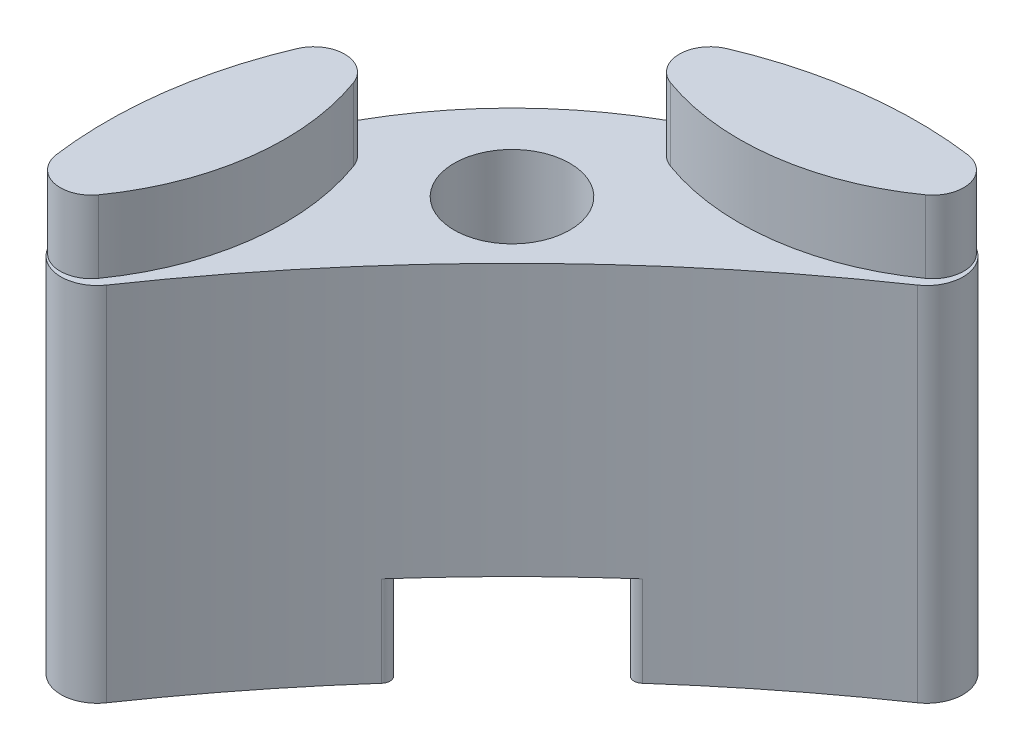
ISO-10303-21;
HEADER;
FILE_DESCRIPTION(('STEP AP214'),'2;1');
FILE_NAME('part.step','',(''),(''),'','','');
FILE_SCHEMA(('AUTOMOTIVE_DESIGN { 1 0 10303 214 1 1 1 1 }'));
ENDSEC;
DATA;
#1=APPLICATION_CONTEXT('core data for automotive mechanical design processes');
#2=APPLICATION_PROTOCOL_DEFINITION('international standard','automotive_design',2000,#1);
#3=PRODUCT_CONTEXT('',#1,'mechanical');
#4=PRODUCT('Part','Part','',(#3));
#5=PRODUCT_RELATED_PRODUCT_CATEGORY('part','',(#4));
#6=PRODUCT_DEFINITION_FORMATION('','',#4);
#7=PRODUCT_DEFINITION_CONTEXT('part definition',#1,'design');
#8=PRODUCT_DEFINITION('design','',#6,#7);
#9=PRODUCT_DEFINITION_SHAPE('','',#8);
#10=(LENGTH_UNIT() NAMED_UNIT(*) SI_UNIT(.MILLI.,.METRE.));
#11=(NAMED_UNIT(*) PLANE_ANGLE_UNIT() SI_UNIT($,.RADIAN.));
#12=(NAMED_UNIT(*) SI_UNIT($,.STERADIAN.) SOLID_ANGLE_UNIT());
#13=UNCERTAINTY_MEASURE_WITH_UNIT(LENGTH_MEASURE(1.E-05),#10,'distance_accuracy_value','');
#14=(GEOMETRIC_REPRESENTATION_CONTEXT(3) GLOBAL_UNCERTAINTY_ASSIGNED_CONTEXT((#13)) GLOBAL_UNIT_ASSIGNED_CONTEXT((#10,
#11,#12)) REPRESENTATION_CONTEXT('',''));
#15=CARTESIAN_POINT('',(0.,0.,0.));
#16=DIRECTION('',(0.,0.,1.));
#17=DIRECTION('',(1.,0.,0.));
#18=AXIS2_PLACEMENT_3D('',#15,#16,#17);
#19=CARTESIAN_POINT('',(-18.156339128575,-20.,-12.423660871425));
#20=DIRECTION('',(0.,1.,0.));
#21=DIRECTION('',(0.,0.,1.));
#22=AXIS2_PLACEMENT_3D('',#19,#20,#21);
#23=PLANE('',#22);
#24=CARTESIAN_POINT('',(0.,-20.,0.));
#25=DIRECTION('',(0.,1.,0.));
#26=DIRECTION('',(0.,0.,-1.));
#27=AXIS2_PLACEMENT_3D('',#24,#25,#26);
#28=CIRCLE('',#27,43.);
#29=CARTESIAN_POINT('',(-24.282609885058,-20.,-35.487390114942));
#30=VERTEX_POINT('',#29);
#31=CARTESIAN_POINT('',(-28.5515477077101,-20.,-32.1529022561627));
#32=VERTEX_POINT('',#31);
#33=EDGE_CURVE('E263',#30,#32,#28,.T.);
#34=ORIENTED_EDGE('',*,*,#33,.T.);
#35=CARTESIAN_POINT('',(-28.7175450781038,-20.,-32.3398377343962));
#36=DIRECTION('',(0.,1.,0.));
#37=DIRECTION('',(0.,0.,1.));
#38=AXIS2_PLACEMENT_3D('',#35,#36,#37);
#39=CIRCLE('',#38,0.25);
#40=CARTESIAN_POINT('',(-28.9662159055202,-20.,-32.3140924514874));
#41=VERTEX_POINT('',#40);
#42=EDGE_CURVE('E292',#32,#41,#39,.F.);
#43=ORIENTED_EDGE('',*,*,#42,.T.);
#44=CARTESIAN_POINT('',(-32.,-20.,-32.));
#45=DIRECTION('',(0.,-1.,0.));
#46=DIRECTION('',(0.,0.,-1.));
#47=AXIS2_PLACEMENT_3D('',#44,#45,#46);
#48=CIRCLE('',#47,3.05);
#49=CARTESIAN_POINT('',(-32.2935188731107,-20.,-35.0358436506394));
#50=VERTEX_POINT('',#49);
#51=EDGE_CURVE('E235',#50,#41,#48,.T.);
#52=ORIENTED_EDGE('',*,*,#51,.F.);
#53=CARTESIAN_POINT('',(-32.3175777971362,-20.,-35.2846832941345));
#54=DIRECTION('',(0.,1.,0.));
#55=DIRECTION('',(0.,0.,1.));
#56=AXIS2_PLACEMENT_3D('',#53,#54,#55);
#57=CIRCLE('',#56,0.25);
#58=CARTESIAN_POINT('',(-32.457220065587,-20.,-35.4920477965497));
#59=VERTEX_POINT('',#58);
#60=EDGE_CURVE('E290',#50,#59,#57,.F.);
#61=ORIENTED_EDGE('',*,*,#60,.T.);
#62=CARTESIAN_POINT('',(-26.1994491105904,-20.,-26.1994491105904));
#63=DIRECTION('',(0.,-1.,0.));
#64=DIRECTION('',(0.,0.,1.));
#65=AXIS2_PLACEMENT_3D('',#62,#63,#64);
#66=CIRCLE('',#65,11.2032177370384);
#67=CARTESIAN_POINT('',(-24.714802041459,-20.,-37.3038586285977));
#68=VERTEX_POINT('',#67);
#69=EDGE_CURVE('E255',#59,#68,#66,.T.);
#70=ORIENTED_EDGE('',*,*,#69,.T.);
#71=CARTESIAN_POINT('',(-24.84732174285,-20.,-36.31267825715));
#72=DIRECTION('',(0.,-1.,0.));
#73=DIRECTION('',(0.,0.,1.));
#74=AXIS2_PLACEMENT_3D('',#71,#72,#73);
#75=CIRCLE('',#74,1.);
#76=EDGE_CURVE('E260',#68,#30,#75,.T.);
#77=ORIENTED_EDGE('',*,*,#76,.T.);
#78=EDGE_LOOP('',(#34,#43,#52,#61,#70,#77));
#79=FACE_BOUND('',#78,.T.);
#80=ADVANCED_FACE('F41',(#79),#23,.F.);
#81=CARTESIAN_POINT('',(-32.,-20.,-32.));
#82=DIRECTION('',(0.,1.,0.));
#83=DIRECTION('',(0.,0.,1.));
#84=AXIS2_PLACEMENT_3D('',#81,#82,#83);
#85=CYLINDRICAL_SURFACE('',#84,1.6);
#86=CARTESIAN_POINT('',(-32.,-10.,-32.));
#87=DIRECTION('',(0.,-1.,0.));
#88=DIRECTION('',(0.,0.,-1.));
#89=AXIS2_PLACEMENT_3D('',#86,#87,#88);
#90=CIRCLE('',#89,1.6);
#91=CARTESIAN_POINT('',(-32.,-10.,-33.6));
#92=VERTEX_POINT('',#91);
#93=EDGE_CURVE('E248',#92,#92,#90,.T.);
#94=ORIENTED_EDGE('',*,*,#93,.F.);
#95=EDGE_LOOP('',(#94));
#96=FACE_BOUND('',#95,.T.);
#97=CARTESIAN_POINT('',(-32.,-17.5,-32.));
#98=DIRECTION('',(0.,-1.,0.));
#99=DIRECTION('',(0.,0.,-1.));
#100=AXIS2_PLACEMENT_3D('',#97,#98,#99);
#101=CIRCLE('',#100,1.6);
#102=CARTESIAN_POINT('',(-32.,-17.5,-33.6));
#103=VERTEX_POINT('',#102);
#104=EDGE_CURVE('E239',#103,#103,#101,.T.);
#105=ORIENTED_EDGE('',*,*,#104,.T.);
#106=EDGE_LOOP('',(#105));
#107=FACE_BOUND('',#106,.T.);
#108=ADVANCED_FACE('F404',(#96,#107),#85,.F.);
#109=CARTESIAN_POINT('',(-32.3140924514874,-20.,-28.9662159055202));
#110=VERTEX_POINT('',#109);
#111=CARTESIAN_POINT('',(-35.0358436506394,-20.,-32.2935188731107));
#112=VERTEX_POINT('',#111);
#113=EDGE_CURVE('E241',#110,#112,#48,.T.);
#114=ORIENTED_EDGE('',*,*,#113,.F.);
#115=CARTESIAN_POINT('',(-32.3398377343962,-20.,-28.7175450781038));
#116=DIRECTION('',(0.,1.,0.));
#117=DIRECTION('',(0.,0.,1.));
#118=AXIS2_PLACEMENT_3D('',#115,#116,#117);
#119=CIRCLE('',#118,0.25);
#120=CARTESIAN_POINT('',(-32.1529022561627,-20.,-28.5515477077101));
#121=VERTEX_POINT('',#120);
#122=EDGE_CURVE('E304',#110,#121,#119,.F.);
#123=ORIENTED_EDGE('',*,*,#122,.T.);
#124=CARTESIAN_POINT('',(-35.487390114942,-20.,-24.282609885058));
#125=VERTEX_POINT('',#124);
#126=EDGE_CURVE('E262',#121,#125,#28,.T.);
#127=ORIENTED_EDGE('',*,*,#126,.T.);
#128=CARTESIAN_POINT('',(-36.31267825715,-20.,-24.84732174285));
#129=DIRECTION('',(0.,-1.,0.));
#130=DIRECTION('',(0.,0.,1.));
#131=AXIS2_PLACEMENT_3D('',#128,#129,#130);
#132=CIRCLE('',#131,0.999999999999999);
#133=CARTESIAN_POINT('',(-37.3038586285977,-20.,-24.7148020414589));
#134=VERTEX_POINT('',#133);
#135=EDGE_CURVE('E252',#125,#134,#132,.T.);
#136=ORIENTED_EDGE('',*,*,#135,.T.);
#137=CARTESIAN_POINT('',(-35.4920477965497,-20.,-32.457220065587));
#138=VERTEX_POINT('',#137);
#139=EDGE_CURVE('E257',#134,#138,#66,.T.);
#140=ORIENTED_EDGE('',*,*,#139,.T.);
#141=CARTESIAN_POINT('',(-35.2846832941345,-20.,-32.3175777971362));
#142=DIRECTION('',(0.,1.,0.));
#143=DIRECTION('',(0.,0.,1.));
#144=AXIS2_PLACEMENT_3D('',#141,#142,#143);
#145=CIRCLE('',#144,0.25);
#146=EDGE_CURVE('E302',#138,#112,#145,.F.);
#147=ORIENTED_EDGE('',*,*,#146,.T.);
#148=EDGE_LOOP('',(#114,#123,#127,#136,#140,#147));
#149=FACE_BOUND('',#148,.T.);
#150=ADVANCED_FACE('F330',(#149),#23,.F.);
#151=CARTESIAN_POINT('',(-18.156339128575,-10.,-12.423660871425));
#152=DIRECTION('',(0.,1.,0.));
#153=DIRECTION('',(0.,0.,1.));
#154=AXIS2_PLACEMENT_3D('',#151,#152,#153);
#155=PLANE('',#154);
#156=CARTESIAN_POINT('',(-28.2355928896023,-10.,-41.2644071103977));
#157=DIRECTION('',(0.,1.,0.));
#158=DIRECTION('',(0.,0.,1.));
#159=AXIS2_PLACEMENT_3D('',#156,#157,#158);
#160=CIRCLE('',#159,6.75);
#161=CARTESIAN_POINT('',(-30.5357551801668,-10.,-34.9184041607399));
#162=VERTEX_POINT('',#161);
#163=CARTESIAN_POINT('',(-24.3333129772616,-10.,-35.7567114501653));
#164=VERTEX_POINT('',#163);
#165=EDGE_CURVE('E172',#162,#164,#160,.T.);
#166=ORIENTED_EDGE('',*,*,#165,.F.);
#167=CARTESIAN_POINT('',(-30.2440153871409,-10.,-35.723295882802));
#168=DIRECTION('',(0.,1.,0.));
#169=DIRECTION('',(0.,0.,1.));
#170=AXIS2_PLACEMENT_3D('',#167,#168,#169);
#171=CIRCLE('',#170,0.856132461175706);
#172=CARTESIAN_POINT('',(-30.5786685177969,-10.,-36.5113124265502));
#173=VERTEX_POINT('',#172);
#174=EDGE_CURVE('E181',#173,#162,#171,.T.);
#175=ORIENTED_EDGE('',*,*,#174,.F.);
#176=CARTESIAN_POINT('',(-26.1994491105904,-10.,-26.1994491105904));
#177=DIRECTION('',(0.,-1.,0.));
#178=DIRECTION('',(0.,0.,1.));
#179=AXIS2_PLACEMENT_3D('',#176,#177,#178);
#180=CIRCLE('',#179,11.2032177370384);
#181=CARTESIAN_POINT('',(-36.5113124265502,-10.,-30.5786685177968));
#182=VERTEX_POINT('',#181);
#183=EDGE_CURVE('E62',#182,#173,#180,.T.);
#184=ORIENTED_EDGE('',*,*,#183,.F.);
#185=CARTESIAN_POINT('',(-35.723295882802,-10.,-30.2440153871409));
#186=DIRECTION('',(0.,1.,0.));
#187=DIRECTION('',(0.,0.,-1.));
#188=AXIS2_PLACEMENT_3D('',#185,#186,#187);
#189=CIRCLE('',#188,0.856132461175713);
#190=CARTESIAN_POINT('',(-34.9184041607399,-10.,-30.5357551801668));
#191=VERTEX_POINT('',#190);
#192=EDGE_CURVE('E214',#191,#182,#189,.T.);
#193=ORIENTED_EDGE('',*,*,#192,.F.);
#194=CARTESIAN_POINT('',(-41.2644071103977,-10.,-28.2355928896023));
#195=DIRECTION('',(0.,1.,0.));
#196=DIRECTION('',(0.,0.,-1.));
#197=AXIS2_PLACEMENT_3D('',#194,#195,#196);
#198=CIRCLE('',#197,6.75);
#199=CARTESIAN_POINT('',(-35.7567114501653,-10.,-24.3333129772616));
#200=VERTEX_POINT('',#199);
#201=EDGE_CURVE('E56',#200,#191,#198,.T.);
#202=ORIENTED_EDGE('',*,*,#201,.F.);
#203=CARTESIAN_POINT('',(-36.4552769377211,-10.,-24.8282564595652));
#204=DIRECTION('',(0.,1.,0.));
#205=DIRECTION('',(0.,0.,-1.));
#206=AXIS2_PLACEMENT_3D('',#203,#204,#205);
#207=CIRCLE('',#206,0.856132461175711);
#208=CARTESIAN_POINT('',(-37.3038586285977,-10.,-24.7148020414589));
#209=VERTEX_POINT('',#208);
#210=EDGE_CURVE('E205',#209,#200,#207,.T.);
#211=ORIENTED_EDGE('',*,*,#210,.F.);
#212=CARTESIAN_POINT('',(-36.31267825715,-10.,-24.84732174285));
#213=DIRECTION('',(0.,-1.,0.));
#214=DIRECTION('',(0.,0.,1.));
#215=AXIS2_PLACEMENT_3D('',#212,#213,#214);
#216=CIRCLE('',#215,0.999999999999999);
#217=CARTESIAN_POINT('',(-35.487390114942,-10.,-24.282609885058));
#218=VERTEX_POINT('',#217);
#219=EDGE_CURVE('E251',#218,#209,#216,.T.);
#220=ORIENTED_EDGE('',*,*,#219,.F.);
#221=CARTESIAN_POINT('',(0.,-10.,0.));
#222=DIRECTION('',(0.,1.,0.));
#223=DIRECTION('',(0.,0.,-1.));
#224=AXIS2_PLACEMENT_3D('',#221,#222,#223);
#225=CIRCLE('',#224,43.);
#226=CARTESIAN_POINT('',(-24.282609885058,-10.,-35.487390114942));
#227=VERTEX_POINT('',#226);
#228=EDGE_CURVE('E256',#227,#218,#225,.T.);
#229=ORIENTED_EDGE('',*,*,#228,.F.);
#230=CARTESIAN_POINT('',(-24.84732174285,-10.,-36.31267825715));
#231=DIRECTION('',(0.,-1.,0.));
#232=DIRECTION('',(0.,0.,1.));
#233=AXIS2_PLACEMENT_3D('',#230,#231,#232);
#234=CIRCLE('',#233,1.);
#235=CARTESIAN_POINT('',(-24.714802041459,-10.,-37.3038586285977));
#236=VERTEX_POINT('',#235);
#237=EDGE_CURVE('E196',#236,#227,#234,.T.);
#238=ORIENTED_EDGE('',*,*,#237,.F.);
#239=CARTESIAN_POINT('',(-24.8282564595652,-10.,-36.4552769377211));
#240=DIRECTION('',(0.,1.,0.));
#241=DIRECTION('',(0.,0.,1.));
#242=AXIS2_PLACEMENT_3D('',#239,#240,#241);
#243=CIRCLE('',#242,0.856132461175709);
#244=EDGE_CURVE('E182',#164,#236,#243,.T.);
#245=ORIENTED_EDGE('',*,*,#244,.F.);
#246=EDGE_LOOP('',(#166,#175,#184,#193,#202,#211,#220,#229,#238,#245));
#247=FACE_BOUND('',#246,.T.);
#248=ORIENTED_EDGE('',*,*,#93,.T.);
#249=EDGE_LOOP('',(#248));
#250=FACE_BOUND('',#249,.T.);
#251=ADVANCED_FACE('F193',(#247,#250),#155,.T.);
#252=CARTESIAN_POINT('',(-36.31267825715,-20.,-24.84732174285));
#253=DIRECTION('',(0.,1.,0.));
#254=DIRECTION('',(0.,0.,1.));
#255=AXIS2_PLACEMENT_3D('',#252,#253,#254);
#256=CYLINDRICAL_SURFACE('',#255,0.999999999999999);
#257=ORIENTED_EDGE('',*,*,#219,.T.);
#258=DIRECTION('',(0.,1.,0.));
#259=VECTOR('',#258,1.);
#260=CARTESIAN_POINT('',(-37.3038586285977,-20.,-24.7148020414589));
#261=LINE('',#260,#259);
#262=EDGE_CURVE('E279',#134,#209,#261,.T.);
#263=ORIENTED_EDGE('',*,*,#262,.F.);
#264=ORIENTED_EDGE('',*,*,#135,.F.);
#265=DIRECTION('',(0.,1.,0.));
#266=VECTOR('',#265,1.);
#267=CARTESIAN_POINT('',(-35.487390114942,-20.,-24.282609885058));
#268=LINE('',#267,#266);
#269=EDGE_CURVE('E266',#125,#218,#268,.T.);
#270=ORIENTED_EDGE('',*,*,#269,.T.);
#271=EDGE_LOOP('',(#257,#263,#264,#270));
#272=FACE_BOUND('',#271,.T.);
#273=ADVANCED_FACE('F336',(#272),#256,.T.);
#274=CARTESIAN_POINT('',(-26.1994491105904,-20.,-26.1994491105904));
#275=DIRECTION('',(0.,1.,0.));
#276=DIRECTION('',(0.,0.,1.));
#277=AXIS2_PLACEMENT_3D('',#274,#275,#276);
#278=CYLINDRICAL_SURFACE('',#277,11.2032177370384);
#279=CARTESIAN_POINT('',(-26.1994491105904,-17.5,-26.1994491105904));
#280=DIRECTION('',(0.,-1.,0.));
#281=DIRECTION('',(0.,0.,-1.));
#282=AXIS2_PLACEMENT_3D('',#279,#280,#281);
#283=CIRCLE('',#282,11.2032177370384);
#284=CARTESIAN_POINT('',(-35.4920477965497,-17.5,-32.457220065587));
#285=VERTEX_POINT('',#284);
#286=CARTESIAN_POINT('',(-32.457220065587,-17.5,-35.4920477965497));
#287=VERTEX_POINT('',#286);
#288=EDGE_CURVE('E246',#285,#287,#283,.T.);
#289=ORIENTED_EDGE('',*,*,#288,.F.);
#290=DIRECTION('',(0.,1.,0.));
#291=VECTOR('',#290,1.);
#292=CARTESIAN_POINT('',(-35.4920477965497,-20.,-32.457220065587));
#293=LINE('',#292,#291);
#294=EDGE_CURVE('E309',#285,#138,#293,.F.);
#295=ORIENTED_EDGE('',*,*,#294,.T.);
#296=ORIENTED_EDGE('',*,*,#139,.F.);
#297=ORIENTED_EDGE('',*,*,#262,.T.);
#298=DIRECTION('',(0.,-1.,0.));
#299=VECTOR('',#298,1.);
#300=CARTESIAN_POINT('',(-37.3038586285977,-8.,-24.7148020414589));
#301=LINE('',#300,#299);
#302=CARTESIAN_POINT('',(-37.3038586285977,-8.,-24.7148020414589));
#303=VERTEX_POINT('',#302);
#304=EDGE_CURVE('E220',#303,#209,#301,.T.);
#305=ORIENTED_EDGE('',*,*,#304,.F.);
#306=CARTESIAN_POINT('',(-26.1994491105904,-8.,-26.1994491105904));
#307=DIRECTION('',(0.,1.,0.));
#308=DIRECTION('',(0.,0.,-1.));
#309=AXIS2_PLACEMENT_3D('',#306,#307,#308);
#310=CIRCLE('',#309,11.2032177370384);
#311=CARTESIAN_POINT('',(-36.5113124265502,-8.,-30.5786685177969));
#312=VERTEX_POINT('',#311);
#313=EDGE_CURVE('E218',#312,#303,#310,.T.);
#314=ORIENTED_EDGE('',*,*,#313,.F.);
#315=DIRECTION('',(0.,-1.,0.));
#316=VECTOR('',#315,1.);
#317=CARTESIAN_POINT('',(-36.5113124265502,-8.,-30.5786685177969));
#318=LINE('',#317,#316);
#319=EDGE_CURVE('E227',#312,#182,#318,.T.);
#320=ORIENTED_EDGE('',*,*,#319,.T.);
#321=ORIENTED_EDGE('',*,*,#183,.T.);
#322=DIRECTION('',(0.,-1.,0.));
#323=VECTOR('',#322,1.);
#324=CARTESIAN_POINT('',(-30.5786685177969,-8.,-36.5113124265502));
#325=LINE('',#324,#323);
#326=CARTESIAN_POINT('',(-30.5786685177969,-8.,-36.5113124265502));
#327=VERTEX_POINT('',#326);
#328=EDGE_CURVE('E353',#327,#173,#325,.T.);
#329=ORIENTED_EDGE('',*,*,#328,.F.);
#330=CARTESIAN_POINT('',(-26.1994491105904,-8.,-26.1994491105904));
#331=DIRECTION('',(0.,1.,0.));
#332=DIRECTION('',(0.,0.,1.));
#333=AXIS2_PLACEMENT_3D('',#330,#331,#332);
#334=CIRCLE('',#333,11.2032177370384);
#335=CARTESIAN_POINT('',(-24.7148020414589,-8.,-37.3038586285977));
#336=VERTEX_POINT('',#335);
#337=EDGE_CURVE('E197',#336,#327,#334,.T.);
#338=ORIENTED_EDGE('',*,*,#337,.F.);
#339=DIRECTION('',(0.,-1.,0.));
#340=VECTOR('',#339,1.);
#341=CARTESIAN_POINT('',(-24.7148020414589,-8.,-37.3038586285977));
#342=LINE('',#341,#340);
#343=EDGE_CURVE('E190',#336,#236,#342,.T.);
#344=ORIENTED_EDGE('',*,*,#343,.T.);
#345=DIRECTION('',(0.,1.,0.));
#346=VECTOR('',#345,1.);
#347=CARTESIAN_POINT('',(-24.714802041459,-20.,-37.3038586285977));
#348=LINE('',#347,#346);
#349=EDGE_CURVE('E277',#68,#236,#348,.T.);
#350=ORIENTED_EDGE('',*,*,#349,.F.);
#351=ORIENTED_EDGE('',*,*,#69,.F.);
#352=DIRECTION('',(0.,1.,0.));
#353=VECTOR('',#352,1.);
#354=CARTESIAN_POINT('',(-32.457220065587,-20.,-35.4920477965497));
#355=LINE('',#354,#353);
#356=EDGE_CURVE('E306',#59,#287,#355,.T.);
#357=ORIENTED_EDGE('',*,*,#356,.T.);
#358=EDGE_LOOP('',(#289,#295,#296,#297,#305,#314,#320,#321,#329,#338,#344,#350,#351,#357));
#359=FACE_BOUND('',#358,.T.);
#360=ADVANCED_FACE('F327',(#359),#278,.T.);
#361=CARTESIAN_POINT('',(-24.84732174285,-20.,-36.31267825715));
#362=DIRECTION('',(0.,1.,0.));
#363=DIRECTION('',(0.,0.,1.));
#364=AXIS2_PLACEMENT_3D('',#361,#362,#363);
#365=CYLINDRICAL_SURFACE('',#364,1.);
#366=ORIENTED_EDGE('',*,*,#237,.T.);
#367=DIRECTION('',(0.,1.,0.));
#368=VECTOR('',#367,1.);
#369=CARTESIAN_POINT('',(-24.282609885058,-20.,-35.487390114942));
#370=LINE('',#369,#368);
#371=EDGE_CURVE('E274',#30,#227,#370,.T.);
#372=ORIENTED_EDGE('',*,*,#371,.F.);
#373=ORIENTED_EDGE('',*,*,#76,.F.);
#374=ORIENTED_EDGE('',*,*,#349,.T.);
#375=EDGE_LOOP('',(#366,#372,#373,#374));
#376=FACE_BOUND('',#375,.T.);
#377=ADVANCED_FACE('F366',(#376),#365,.T.);
#378=CARTESIAN_POINT('',(0.,-20.,0.));
#379=DIRECTION('',(0.,1.,0.));
#380=DIRECTION('',(0.,0.,1.));
#381=AXIS2_PLACEMENT_3D('',#378,#379,#380);
#382=CYLINDRICAL_SURFACE('',#381,43.);
#383=CARTESIAN_POINT('',(0.,-17.5,0.));
#384=DIRECTION('',(0.,-1.,0.));
#385=DIRECTION('',(0.,0.,-1.));
#386=AXIS2_PLACEMENT_3D('',#383,#384,#385);
#387=CIRCLE('',#386,43.);
#388=CARTESIAN_POINT('',(-28.5515477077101,-17.5,-32.1529022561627));
#389=VERTEX_POINT('',#388);
#390=CARTESIAN_POINT('',(-32.1529022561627,-17.5,-28.5515477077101));
#391=VERTEX_POINT('',#390);
#392=EDGE_CURVE('E244',#389,#391,#387,.F.);
#393=ORIENTED_EDGE('',*,*,#392,.F.);
#394=DIRECTION('',(0.,1.,0.));
#395=VECTOR('',#394,1.);
#396=CARTESIAN_POINT('',(-28.5515477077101,-20.,-32.1529022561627));
#397=LINE('',#396,#395);
#398=EDGE_CURVE('E287',#389,#32,#397,.F.);
#399=ORIENTED_EDGE('',*,*,#398,.T.);
#400=ORIENTED_EDGE('',*,*,#33,.F.);
#401=ORIENTED_EDGE('',*,*,#371,.T.);
#402=ORIENTED_EDGE('',*,*,#228,.T.);
#403=ORIENTED_EDGE('',*,*,#269,.F.);
#404=ORIENTED_EDGE('',*,*,#126,.F.);
#405=DIRECTION('',(0.,1.,0.));
#406=VECTOR('',#405,1.);
#407=CARTESIAN_POINT('',(-32.1529022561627,-20.,-28.5515477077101));
#408=LINE('',#407,#406);
#409=EDGE_CURVE('E282',#121,#391,#408,.T.);
#410=ORIENTED_EDGE('',*,*,#409,.T.);
#411=EDGE_LOOP('',(#393,#399,#400,#401,#402,#403,#404,#410));
#412=FACE_BOUND('',#411,.T.);
#413=ADVANCED_FACE('F390',(#412),#382,.F.);
#414=CARTESIAN_POINT('',(-32.,-17.5,-32.));
#415=DIRECTION('',(0.,-1.,0.));
#416=DIRECTION('',(0.,0.,-1.));
#417=AXIS2_PLACEMENT_3D('',#414,#415,#416);
#418=CYLINDRICAL_SURFACE('',#417,3.05);
#419=CARTESIAN_POINT('',(-32.,-17.5,-32.));
#420=DIRECTION('',(0.,-1.,0.));
#421=DIRECTION('',(0.,0.,-1.));
#422=AXIS2_PLACEMENT_3D('',#419,#420,#421);
#423=CIRCLE('',#422,3.05);
#424=CARTESIAN_POINT('',(-32.3140924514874,-17.5,-28.9662159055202));
#425=VERTEX_POINT('',#424);
#426=CARTESIAN_POINT('',(-35.0358436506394,-17.5,-32.2935188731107));
#427=VERTEX_POINT('',#426);
#428=EDGE_CURVE('E236',#425,#427,#423,.T.);
#429=ORIENTED_EDGE('',*,*,#428,.F.);
#430=DIRECTION('',(0.,-1.,0.));
#431=VECTOR('',#430,1.);
#432=CARTESIAN_POINT('',(-32.3140924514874,-17.5,-28.9662159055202));
#433=LINE('',#432,#431);
#434=EDGE_CURVE('E300',#425,#110,#433,.T.);
#435=ORIENTED_EDGE('',*,*,#434,.T.);
#436=ORIENTED_EDGE('',*,*,#113,.T.);
#437=DIRECTION('',(0.,-1.,0.));
#438=VECTOR('',#437,1.);
#439=CARTESIAN_POINT('',(-35.0358436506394,-17.5,-32.2935188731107));
#440=LINE('',#439,#438);
#441=EDGE_CURVE('E298',#112,#427,#440,.F.);
#442=ORIENTED_EDGE('',*,*,#441,.T.);
#443=EDGE_LOOP('',(#429,#435,#436,#442));
#444=FACE_BOUND('',#443,.T.);
#445=ADVANCED_FACE('F392',(#444),#418,.F.);
#446=ORIENTED_EDGE('',*,*,#51,.T.);
#447=DIRECTION('',(0.,-1.,0.));
#448=VECTOR('',#447,1.);
#449=CARTESIAN_POINT('',(-28.9662159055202,-17.5,-32.3140924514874));
#450=LINE('',#449,#448);
#451=CARTESIAN_POINT('',(-28.9662159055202,-17.5,-32.3140924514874));
#452=VERTEX_POINT('',#451);
#453=EDGE_CURVE('E296',#41,#452,#450,.F.);
#454=ORIENTED_EDGE('',*,*,#453,.T.);
#455=CARTESIAN_POINT('',(-32.2935188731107,-17.5,-35.0358436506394));
#456=VERTEX_POINT('',#455);
#457=EDGE_CURVE('E240',#456,#452,#423,.T.);
#458=ORIENTED_EDGE('',*,*,#457,.F.);
#459=DIRECTION('',(0.,-1.,0.));
#460=VECTOR('',#459,1.);
#461=CARTESIAN_POINT('',(-32.2935188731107,-17.5,-35.0358436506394));
#462=LINE('',#461,#460);
#463=EDGE_CURVE('E294',#456,#50,#462,.T.);
#464=ORIENTED_EDGE('',*,*,#463,.T.);
#465=EDGE_LOOP('',(#446,#454,#458,#464));
#466=FACE_BOUND('',#465,.T.);
#467=ADVANCED_FACE('F378',(#466),#418,.F.);
#468=CARTESIAN_POINT('',(-32.,-17.5,-32.));
#469=DIRECTION('',(0.,-1.,0.));
#470=DIRECTION('',(0.,0.,-1.));
#471=AXIS2_PLACEMENT_3D('',#468,#469,#470);
#472=PLANE('',#471);
#473=ORIENTED_EDGE('',*,*,#104,.F.);
#474=EDGE_LOOP('',(#473));
#475=FACE_BOUND('',#474,.T.);
#476=ORIENTED_EDGE('',*,*,#288,.T.);
#477=CARTESIAN_POINT('',(-32.3175777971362,-17.5,-35.2846832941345));
#478=DIRECTION('',(0.,-1.,0.));
#479=DIRECTION('',(0.,0.,-1.));
#480=AXIS2_PLACEMENT_3D('',#477,#478,#479);
#481=CIRCLE('',#480,0.25);
#482=EDGE_CURVE('E11',#287,#456,#481,.F.);
#483=ORIENTED_EDGE('',*,*,#482,.T.);
#484=ORIENTED_EDGE('',*,*,#457,.T.);
#485=CARTESIAN_POINT('',(-28.7175450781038,-17.5,-32.3398377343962));
#486=DIRECTION('',(0.,-1.,0.));
#487=DIRECTION('',(0.,0.,-1.));
#488=AXIS2_PLACEMENT_3D('',#485,#486,#487);
#489=CIRCLE('',#488,0.25);
#490=EDGE_CURVE('E312',#452,#389,#489,.F.);
#491=ORIENTED_EDGE('',*,*,#490,.T.);
#492=ORIENTED_EDGE('',*,*,#392,.T.);
#493=CARTESIAN_POINT('',(-32.3398377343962,-17.5,-28.7175450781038));
#494=DIRECTION('',(0.,-1.,0.));
#495=DIRECTION('',(0.,0.,-1.));
#496=AXIS2_PLACEMENT_3D('',#493,#494,#495);
#497=CIRCLE('',#496,0.25);
#498=EDGE_CURVE('E315',#391,#425,#497,.F.);
#499=ORIENTED_EDGE('',*,*,#498,.T.);
#500=ORIENTED_EDGE('',*,*,#428,.T.);
#501=CARTESIAN_POINT('',(-35.2846832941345,-17.5,-32.3175777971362));
#502=DIRECTION('',(0.,-1.,0.));
#503=DIRECTION('',(0.,0.,-1.));
#504=AXIS2_PLACEMENT_3D('',#501,#502,#503);
#505=CIRCLE('',#504,0.25);
#506=EDGE_CURVE('E49',#427,#285,#505,.F.);
#507=ORIENTED_EDGE('',*,*,#506,.T.);
#508=EDGE_LOOP('',(#476,#483,#484,#491,#492,#499,#500,#507));
#509=FACE_BOUND('',#508,.T.);
#510=ADVANCED_FACE('F320',(#475,#509),#472,.T.);
#511=CARTESIAN_POINT('',(-28.7175450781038,-17.5,-32.3398377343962));
#512=DIRECTION('',(0.,-1.,0.));
#513=DIRECTION('',(0.,0.,-1.));
#514=AXIS2_PLACEMENT_3D('',#511,#512,#513);
#515=CYLINDRICAL_SURFACE('',#514,0.25);
#516=ORIENTED_EDGE('',*,*,#490,.F.);
#517=ORIENTED_EDGE('',*,*,#453,.F.);
#518=ORIENTED_EDGE('',*,*,#42,.F.);
#519=ORIENTED_EDGE('',*,*,#398,.F.);
#520=EDGE_LOOP('',(#516,#517,#518,#519));
#521=FACE_BOUND('',#520,.T.);
#522=ADVANCED_FACE('F381',(#521),#515,.T.);
#523=CARTESIAN_POINT('',(-32.3398377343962,-17.5,-28.7175450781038));
#524=DIRECTION('',(0.,1.,0.));
#525=DIRECTION('',(0.,0.,1.));
#526=AXIS2_PLACEMENT_3D('',#523,#524,#525);
#527=CYLINDRICAL_SURFACE('',#526,0.25);
#528=ORIENTED_EDGE('',*,*,#122,.F.);
#529=ORIENTED_EDGE('',*,*,#434,.F.);
#530=ORIENTED_EDGE('',*,*,#498,.F.);
#531=ORIENTED_EDGE('',*,*,#409,.F.);
#532=EDGE_LOOP('',(#528,#529,#530,#531));
#533=FACE_BOUND('',#532,.T.);
#534=ADVANCED_FACE('F389',(#533),#527,.T.);
#535=CARTESIAN_POINT('',(-35.2846832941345,-17.5,-32.3175777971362));
#536=DIRECTION('',(0.,1.,0.));
#537=DIRECTION('',(0.,0.,1.));
#538=AXIS2_PLACEMENT_3D('',#535,#536,#537);
#539=CYLINDRICAL_SURFACE('',#538,0.25);
#540=ORIENTED_EDGE('',*,*,#506,.F.);
#541=ORIENTED_EDGE('',*,*,#441,.F.);
#542=ORIENTED_EDGE('',*,*,#146,.F.);
#543=ORIENTED_EDGE('',*,*,#294,.F.);
#544=EDGE_LOOP('',(#540,#541,#542,#543));
#545=FACE_BOUND('',#544,.T.);
#546=ADVANCED_FACE('F325',(#545),#539,.T.);
#547=CARTESIAN_POINT('',(-32.3175777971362,-17.5,-35.2846832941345));
#548=DIRECTION('',(0.,-1.,0.));
#549=DIRECTION('',(0.,0.,-1.));
#550=AXIS2_PLACEMENT_3D('',#547,#548,#549);
#551=CYLINDRICAL_SURFACE('',#550,0.25);
#552=ORIENTED_EDGE('',*,*,#60,.F.);
#553=ORIENTED_EDGE('',*,*,#463,.F.);
#554=ORIENTED_EDGE('',*,*,#482,.F.);
#555=ORIENTED_EDGE('',*,*,#356,.F.);
#556=EDGE_LOOP('',(#552,#553,#554,#555));
#557=FACE_BOUND('',#556,.T.);
#558=ADVANCED_FACE('F43',(#557),#551,.T.);
#559=CARTESIAN_POINT('',(-36.4552769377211,-8.,-24.8282564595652));
#560=DIRECTION('',(0.,-1.,0.));
#561=DIRECTION('',(0.,0.,-1.));
#562=AXIS2_PLACEMENT_3D('',#559,#560,#561);
#563=CYLINDRICAL_SURFACE('',#562,0.856132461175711);
#564=ORIENTED_EDGE('',*,*,#210,.T.);
#565=DIRECTION('',(0.,-1.,0.));
#566=VECTOR('',#565,1.);
#567=CARTESIAN_POINT('',(-35.7567114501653,-8.,-24.3333129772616));
#568=LINE('',#567,#566);
#569=CARTESIAN_POINT('',(-35.7567114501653,-8.,-24.3333129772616));
#570=VERTEX_POINT('',#569);
#571=EDGE_CURVE('E233',#570,#200,#568,.T.);
#572=ORIENTED_EDGE('',*,*,#571,.F.);
#573=CARTESIAN_POINT('',(-36.4552769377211,-8.,-24.8282564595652));
#574=DIRECTION('',(0.,1.,0.));
#575=DIRECTION('',(0.,0.,-1.));
#576=AXIS2_PLACEMENT_3D('',#573,#574,#575);
#577=CIRCLE('',#576,0.856132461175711);
#578=EDGE_CURVE('E210',#303,#570,#577,.T.);
#579=ORIENTED_EDGE('',*,*,#578,.F.);
#580=ORIENTED_EDGE('',*,*,#304,.T.);
#581=EDGE_LOOP('',(#564,#572,#579,#580));
#582=FACE_BOUND('',#581,.T.);
#583=ADVANCED_FACE('F343',(#582),#563,.T.);
#584=CARTESIAN_POINT('',(-41.2644071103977,-8.,-28.2355928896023));
#585=DIRECTION('',(0.,-1.,0.));
#586=DIRECTION('',(0.,0.,-1.));
#587=AXIS2_PLACEMENT_3D('',#584,#585,#586);
#588=CYLINDRICAL_SURFACE('',#587,6.75);
#589=ORIENTED_EDGE('',*,*,#201,.T.);
#590=DIRECTION('',(0.,-1.,0.));
#591=VECTOR('',#590,1.);
#592=CARTESIAN_POINT('',(-34.9184041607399,-8.,-30.5357551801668));
#593=LINE('',#592,#591);
#594=CARTESIAN_POINT('',(-34.9184041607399,-8.,-30.5357551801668));
#595=VERTEX_POINT('',#594);
#596=EDGE_CURVE('E230',#595,#191,#593,.T.);
#597=ORIENTED_EDGE('',*,*,#596,.F.);
#598=CARTESIAN_POINT('',(-41.2644071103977,-8.,-28.2355928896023));
#599=DIRECTION('',(0.,1.,0.));
#600=DIRECTION('',(0.,0.,-1.));
#601=AXIS2_PLACEMENT_3D('',#598,#599,#600);
#602=CIRCLE('',#601,6.75);
#603=EDGE_CURVE('E213',#570,#595,#602,.T.);
#604=ORIENTED_EDGE('',*,*,#603,.F.);
#605=ORIENTED_EDGE('',*,*,#571,.T.);
#606=EDGE_LOOP('',(#589,#597,#604,#605));
#607=FACE_BOUND('',#606,.T.);
#608=ADVANCED_FACE('F433',(#607),#588,.T.);
#609=CARTESIAN_POINT('',(-35.723295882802,-8.,-30.2440153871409));
#610=DIRECTION('',(0.,-1.,0.));
#611=DIRECTION('',(0.,0.,-1.));
#612=AXIS2_PLACEMENT_3D('',#609,#610,#611);
#613=CYLINDRICAL_SURFACE('',#612,0.856132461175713);
#614=ORIENTED_EDGE('',*,*,#192,.T.);
#615=ORIENTED_EDGE('',*,*,#319,.F.);
#616=CARTESIAN_POINT('',(-35.723295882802,-8.,-30.2440153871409));
#617=DIRECTION('',(0.,1.,0.));
#618=DIRECTION('',(0.,0.,-1.));
#619=AXIS2_PLACEMENT_3D('',#616,#617,#618);
#620=CIRCLE('',#619,0.856132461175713);
#621=EDGE_CURVE('E216',#595,#312,#620,.T.);
#622=ORIENTED_EDGE('',*,*,#621,.F.);
#623=ORIENTED_EDGE('',*,*,#596,.T.);
#624=EDGE_LOOP('',(#614,#615,#622,#623));
#625=FACE_BOUND('',#624,.T.);
#626=ADVANCED_FACE('F350',(#625),#613,.T.);
#627=CARTESIAN_POINT('',(-31.3273630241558,-8.,-25.5138527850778));
#628=DIRECTION('',(0.,-1.,0.));
#629=DIRECTION('',(0.,0.,-1.));
#630=AXIS2_PLACEMENT_3D('',#627,#628,#629);
#631=PLANE('',#630);
#632=ORIENTED_EDGE('',*,*,#578,.T.);
#633=ORIENTED_EDGE('',*,*,#603,.T.);
#634=ORIENTED_EDGE('',*,*,#621,.T.);
#635=ORIENTED_EDGE('',*,*,#313,.T.);
#636=EDGE_LOOP('',(#632,#633,#634,#635));
#637=FACE_BOUND('',#636,.T.);
#638=ADVANCED_FACE('F345',(#637),#631,.F.);
#639=CARTESIAN_POINT('',(-30.2440153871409,-8.,-35.723295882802));
#640=DIRECTION('',(0.,-1.,0.));
#641=DIRECTION('',(0.,0.,-1.));
#642=AXIS2_PLACEMENT_3D('',#639,#640,#641);
#643=CYLINDRICAL_SURFACE('',#642,0.856132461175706);
#644=ORIENTED_EDGE('',*,*,#174,.T.);
#645=DIRECTION('',(0.,-1.,0.));
#646=VECTOR('',#645,1.);
#647=CARTESIAN_POINT('',(-30.5357551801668,-8.,-34.9184041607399));
#648=LINE('',#647,#646);
#649=CARTESIAN_POINT('',(-30.5357551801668,-8.,-34.9184041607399));
#650=VERTEX_POINT('',#649);
#651=EDGE_CURVE('E179',#650,#162,#648,.T.);
#652=ORIENTED_EDGE('',*,*,#651,.F.);
#653=CARTESIAN_POINT('',(-30.2440153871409,-8.,-35.723295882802));
#654=DIRECTION('',(0.,1.,0.));
#655=DIRECTION('',(0.,0.,1.));
#656=AXIS2_PLACEMENT_3D('',#653,#654,#655);
#657=CIRCLE('',#656,0.856132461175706);
#658=EDGE_CURVE('E200',#327,#650,#657,.T.);
#659=ORIENTED_EDGE('',*,*,#658,.F.);
#660=ORIENTED_EDGE('',*,*,#328,.T.);
#661=EDGE_LOOP('',(#644,#652,#659,#660));
#662=FACE_BOUND('',#661,.T.);
#663=ADVANCED_FACE('F357',(#662),#643,.T.);
#664=CARTESIAN_POINT('',(-28.2355928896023,-8.,-41.2644071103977));
#665=DIRECTION('',(0.,-1.,0.));
#666=DIRECTION('',(0.,0.,-1.));
#667=AXIS2_PLACEMENT_3D('',#664,#665,#666);
#668=CYLINDRICAL_SURFACE('',#667,6.75);
#669=ORIENTED_EDGE('',*,*,#165,.T.);
#670=DIRECTION('',(0.,-1.,0.));
#671=VECTOR('',#670,1.);
#672=CARTESIAN_POINT('',(-24.3333129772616,-8.,-35.7567114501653));
#673=LINE('',#672,#671);
#674=CARTESIAN_POINT('',(-24.3333129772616,-8.,-35.7567114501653));
#675=VERTEX_POINT('',#674);
#676=EDGE_CURVE('E176',#675,#164,#673,.T.);
#677=ORIENTED_EDGE('',*,*,#676,.F.);
#678=CARTESIAN_POINT('',(-28.2355928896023,-8.,-41.2644071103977));
#679=DIRECTION('',(0.,1.,0.));
#680=DIRECTION('',(0.,0.,1.));
#681=AXIS2_PLACEMENT_3D('',#678,#679,#680);
#682=CIRCLE('',#681,6.75);
#683=EDGE_CURVE('E207',#650,#675,#682,.T.);
#684=ORIENTED_EDGE('',*,*,#683,.F.);
#685=ORIENTED_EDGE('',*,*,#651,.T.);
#686=EDGE_LOOP('',(#669,#677,#684,#685));
#687=FACE_BOUND('',#686,.T.);
#688=ADVANCED_FACE('F174',(#687),#668,.T.);
#689=CARTESIAN_POINT('',(-24.8282564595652,-8.,-36.4552769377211));
#690=DIRECTION('',(0.,-1.,0.));
#691=DIRECTION('',(0.,0.,-1.));
#692=AXIS2_PLACEMENT_3D('',#689,#690,#691);
#693=CYLINDRICAL_SURFACE('',#692,0.856132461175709);
#694=ORIENTED_EDGE('',*,*,#244,.T.);
#695=ORIENTED_EDGE('',*,*,#343,.F.);
#696=CARTESIAN_POINT('',(-24.8282564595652,-8.,-36.4552769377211));
#697=DIRECTION('',(0.,1.,0.));
#698=DIRECTION('',(0.,0.,1.));
#699=AXIS2_PLACEMENT_3D('',#696,#697,#698);
#700=CIRCLE('',#699,0.856132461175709);
#701=EDGE_CURVE('E189',#675,#336,#700,.T.);
#702=ORIENTED_EDGE('',*,*,#701,.F.);
#703=ORIENTED_EDGE('',*,*,#676,.T.);
#704=EDGE_LOOP('',(#694,#695,#702,#703));
#705=FACE_BOUND('',#704,.T.);
#706=ADVANCED_FACE('F186',(#705),#693,.T.);
#707=CARTESIAN_POINT('',(-28.2217322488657,-8.,-30.9613724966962));
#708=DIRECTION('',(0.,1.,0.));
#709=DIRECTION('',(0.,0.,1.));
#710=AXIS2_PLACEMENT_3D('',#707,#708,#709);
#711=PLANE('',#710);
#712=ORIENTED_EDGE('',*,*,#337,.T.);
#713=ORIENTED_EDGE('',*,*,#658,.T.);
#714=ORIENTED_EDGE('',*,*,#683,.T.);
#715=ORIENTED_EDGE('',*,*,#701,.T.);
#716=EDGE_LOOP('',(#712,#713,#714,#715));
#717=FACE_BOUND('',#716,.T.);
#718=ADVANCED_FACE('F359',(#717),#711,.T.);
#719=CLOSED_SHELL('',(#80,#108,#150,#251,#273,#360,#377,#413,#445,#467,#510,#522,#534,#546,#558,
#583,#608,#626,#638,#663,#688,#706,#718));
#720=MANIFOLD_SOLID_BREP('B2',#719);
#721=ADVANCED_BREP_SHAPE_REPRESENTATION('',(#18,#720),#14);
#722=SHAPE_DEFINITION_REPRESENTATION(#9,#721);
ENDSEC;
END-ISO-10303-21;
